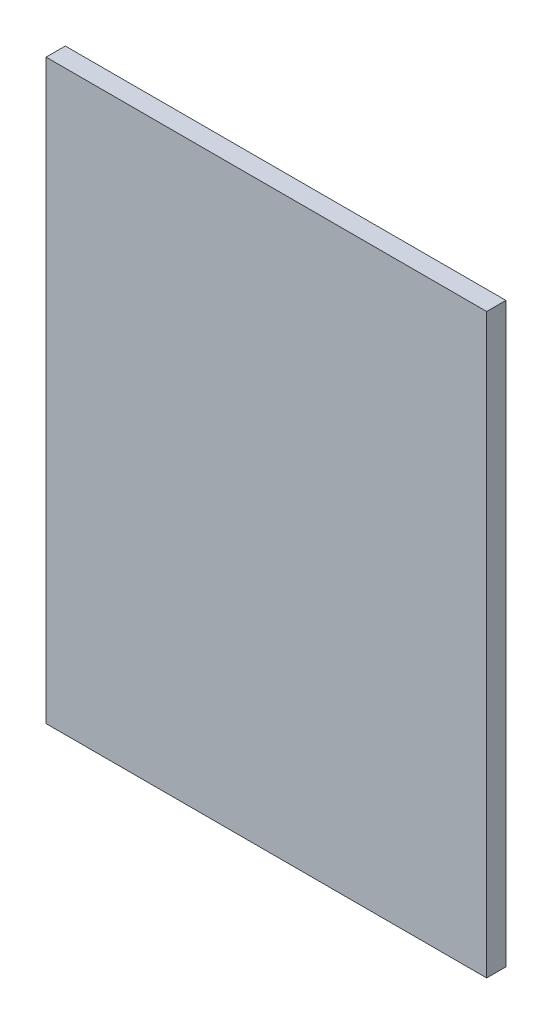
ISO-10303-21;
HEADER;
FILE_DESCRIPTION(('STEP AP214'),'2;1');
FILE_NAME('part.step','',(''),(''),'','','');
FILE_SCHEMA(('AUTOMOTIVE_DESIGN { 1 0 10303 214 1 1 1 1 }'));
ENDSEC;
DATA;
#1=APPLICATION_CONTEXT('core data for automotive mechanical design processes');
#2=APPLICATION_PROTOCOL_DEFINITION('international standard','automotive_design',2000,#1);
#3=PRODUCT_CONTEXT('',#1,'mechanical');
#4=PRODUCT('Part','Part','',(#3));
#5=PRODUCT_RELATED_PRODUCT_CATEGORY('part','',(#4));
#6=PRODUCT_DEFINITION_FORMATION('','',#4);
#7=PRODUCT_DEFINITION_CONTEXT('part definition',#1,'design');
#8=PRODUCT_DEFINITION('design','',#6,#7);
#9=PRODUCT_DEFINITION_SHAPE('','',#8);
#10=(LENGTH_UNIT() NAMED_UNIT(*) SI_UNIT(.MILLI.,.METRE.));
#11=(NAMED_UNIT(*) PLANE_ANGLE_UNIT() SI_UNIT($,.RADIAN.));
#12=(NAMED_UNIT(*) SI_UNIT($,.STERADIAN.) SOLID_ANGLE_UNIT());
#13=UNCERTAINTY_MEASURE_WITH_UNIT(LENGTH_MEASURE(1.E-05),#10,'distance_accuracy_value','');
#14=(GEOMETRIC_REPRESENTATION_CONTEXT(3) GLOBAL_UNCERTAINTY_ASSIGNED_CONTEXT((#13)) GLOBAL_UNIT_ASSIGNED_CONTEXT((#10,
#11,#12)) REPRESENTATION_CONTEXT('',''));
#15=CARTESIAN_POINT('',(0.,0.,0.));
#16=DIRECTION('',(0.,0.,1.));
#17=DIRECTION('',(1.,0.,0.));
#18=AXIS2_PLACEMENT_3D('',#15,#16,#17);
#19=CARTESIAN_POINT('',(0.,0.,5.));
#20=DIRECTION('',(1.,0.,0.));
#21=DIRECTION('',(0.,0.,-1.));
#22=AXIS2_PLACEMENT_3D('',#19,#20,#21);
#23=PLANE('',#22);
#24=DIRECTION('',(0.,-1.,0.));
#25=VECTOR('',#24,1.);
#26=CARTESIAN_POINT('',(0.,0.,0.));
#27=LINE('',#26,#25);
#28=CARTESIAN_POINT('',(0.,150.,0.));
#29=VERTEX_POINT('',#28);
#30=CARTESIAN_POINT('',(0.,0.,0.));
#31=VERTEX_POINT('',#30);
#32=EDGE_CURVE('E107',#29,#31,#27,.T.);
#33=ORIENTED_EDGE('',*,*,#32,.T.);
#34=DIRECTION('',(0.,0.,-1.));
#35=VECTOR('',#34,1.);
#36=CARTESIAN_POINT('',(0.,0.,5.));
#37=LINE('',#36,#35);
#38=CARTESIAN_POINT('',(0.,0.,5.));
#39=VERTEX_POINT('',#38);
#40=EDGE_CURVE('E11',#39,#31,#37,.T.);
#41=ORIENTED_EDGE('',*,*,#40,.F.);
#42=DIRECTION('',(0.,-1.,0.));
#43=VECTOR('',#42,1.);
#44=CARTESIAN_POINT('',(0.,0.,5.));
#45=LINE('',#44,#43);
#46=CARTESIAN_POINT('',(0.,150.,5.));
#47=VERTEX_POINT('',#46);
#48=EDGE_CURVE('E91',#47,#39,#45,.T.);
#49=ORIENTED_EDGE('',*,*,#48,.F.);
#50=DIRECTION('',(0.,0.,-1.));
#51=VECTOR('',#50,1.);
#52=CARTESIAN_POINT('',(0.,150.,5.));
#53=LINE('',#52,#51);
#54=EDGE_CURVE('E103',#47,#29,#53,.T.);
#55=ORIENTED_EDGE('',*,*,#54,.T.);
#56=EDGE_LOOP('',(#33,#41,#49,#55));
#57=FACE_BOUND('',#56,.T.);
#58=ADVANCED_FACE('F39',(#57),#23,.F.);
#59=CARTESIAN_POINT('',(0.,0.,5.));
#60=DIRECTION('',(0.,1.,0.));
#61=DIRECTION('',(0.,0.,1.));
#62=AXIS2_PLACEMENT_3D('',#59,#60,#61);
#63=PLANE('',#62);
#64=DIRECTION('',(1.,0.,0.));
#65=VECTOR('',#64,1.);
#66=CARTESIAN_POINT('',(0.,0.,0.));
#67=LINE('',#66,#65);
#68=CARTESIAN_POINT('',(114.5,0.,0.));
#69=VERTEX_POINT('',#68);
#70=EDGE_CURVE('E96',#31,#69,#67,.T.);
#71=ORIENTED_EDGE('',*,*,#70,.T.);
#72=DIRECTION('',(0.,0.,-1.));
#73=VECTOR('',#72,1.);
#74=CARTESIAN_POINT('',(114.5,0.,5.));
#75=LINE('',#74,#73);
#76=CARTESIAN_POINT('',(114.5,0.,5.));
#77=VERTEX_POINT('',#76);
#78=EDGE_CURVE('E48',#77,#69,#75,.T.);
#79=ORIENTED_EDGE('',*,*,#78,.F.);
#80=DIRECTION('',(1.,0.,0.));
#81=VECTOR('',#80,1.);
#82=CARTESIAN_POINT('',(0.,0.,5.));
#83=LINE('',#82,#81);
#84=EDGE_CURVE('E86',#39,#77,#83,.T.);
#85=ORIENTED_EDGE('',*,*,#84,.F.);
#86=ORIENTED_EDGE('',*,*,#40,.T.);
#87=EDGE_LOOP('',(#71,#79,#85,#86));
#88=FACE_BOUND('',#87,.T.);
#89=ADVANCED_FACE('F95',(#88),#63,.F.);
#90=CARTESIAN_POINT('',(114.5,0.,5.));
#91=DIRECTION('',(-1.,0.,0.));
#92=DIRECTION('',(0.,0.,1.));
#93=AXIS2_PLACEMENT_3D('',#90,#91,#92);
#94=PLANE('',#93);
#95=DIRECTION('',(0.,1.,0.));
#96=VECTOR('',#95,1.);
#97=CARTESIAN_POINT('',(114.5,0.,0.));
#98=LINE('',#97,#96);
#99=CARTESIAN_POINT('',(114.5,150.,0.));
#100=VERTEX_POINT('',#99);
#101=EDGE_CURVE('E73',#69,#100,#98,.T.);
#102=ORIENTED_EDGE('',*,*,#101,.T.);
#103=DIRECTION('',(0.,0.,-1.));
#104=VECTOR('',#103,1.);
#105=CARTESIAN_POINT('',(114.5,150.,5.));
#106=LINE('',#105,#104);
#107=CARTESIAN_POINT('',(114.5,150.,5.));
#108=VERTEX_POINT('',#107);
#109=EDGE_CURVE('E98',#108,#100,#106,.T.);
#110=ORIENTED_EDGE('',*,*,#109,.F.);
#111=DIRECTION('',(0.,1.,0.));
#112=VECTOR('',#111,1.);
#113=CARTESIAN_POINT('',(114.5,0.,5.));
#114=LINE('',#113,#112);
#115=EDGE_CURVE('E89',#77,#108,#114,.T.);
#116=ORIENTED_EDGE('',*,*,#115,.F.);
#117=ORIENTED_EDGE('',*,*,#78,.T.);
#118=EDGE_LOOP('',(#102,#110,#116,#117));
#119=FACE_BOUND('',#118,.T.);
#120=ADVANCED_FACE('F99',(#119),#94,.F.);
#121=CARTESIAN_POINT('',(0.,150.,5.));
#122=DIRECTION('',(0.,-1.,0.));
#123=DIRECTION('',(0.,0.,-1.));
#124=AXIS2_PLACEMENT_3D('',#121,#122,#123);
#125=PLANE('',#124);
#126=DIRECTION('',(-1.,0.,0.));
#127=VECTOR('',#126,1.);
#128=CARTESIAN_POINT('',(0.,150.,0.));
#129=LINE('',#128,#127);
#130=EDGE_CURVE('E79',#100,#29,#129,.T.);
#131=ORIENTED_EDGE('',*,*,#130,.T.);
#132=ORIENTED_EDGE('',*,*,#54,.F.);
#133=DIRECTION('',(-1.,0.,0.));
#134=VECTOR('',#133,1.);
#135=CARTESIAN_POINT('',(0.,150.,5.));
#136=LINE('',#135,#134);
#137=EDGE_CURVE('E56',#108,#47,#136,.T.);
#138=ORIENTED_EDGE('',*,*,#137,.F.);
#139=ORIENTED_EDGE('',*,*,#109,.T.);
#140=EDGE_LOOP('',(#131,#132,#138,#139));
#141=FACE_BOUND('',#140,.T.);
#142=ADVANCED_FACE('F120',(#141),#125,.F.);
#143=CARTESIAN_POINT('',(0.,0.,5.));
#144=DIRECTION('',(0.,0.,-1.));
#145=DIRECTION('',(-1.,0.,0.));
#146=AXIS2_PLACEMENT_3D('',#143,#144,#145);
#147=PLANE('',#146);
#148=ORIENTED_EDGE('',*,*,#48,.T.);
#149=ORIENTED_EDGE('',*,*,#84,.T.);
#150=ORIENTED_EDGE('',*,*,#115,.T.);
#151=ORIENTED_EDGE('',*,*,#137,.T.);
#152=EDGE_LOOP('',(#148,#149,#150,#151));
#153=FACE_BOUND('',#152,.T.);
#154=ADVANCED_FACE('F87',(#153),#147,.F.);
#155=CARTESIAN_POINT('',(0.,0.,0.));
#156=DIRECTION('',(0.,0.,-1.));
#157=DIRECTION('',(-1.,0.,0.));
#158=AXIS2_PLACEMENT_3D('',#155,#156,#157);
#159=PLANE('',#158);
#160=ORIENTED_EDGE('',*,*,#32,.F.);
#161=ORIENTED_EDGE('',*,*,#130,.F.);
#162=ORIENTED_EDGE('',*,*,#101,.F.);
#163=ORIENTED_EDGE('',*,*,#70,.F.);
#164=EDGE_LOOP('',(#160,#161,#162,#163));
#165=FACE_BOUND('',#164,.T.);
#166=ADVANCED_FACE('F123',(#165),#159,.T.);
#167=CLOSED_SHELL('',(#58,#89,#120,#142,#154,#166));
#168=MANIFOLD_SOLID_BREP('B2',#167);
#169=ADVANCED_BREP_SHAPE_REPRESENTATION('',(#18,#168),#14);
#170=SHAPE_DEFINITION_REPRESENTATION(#9,#169);
ENDSEC;
END-ISO-10303-21;
